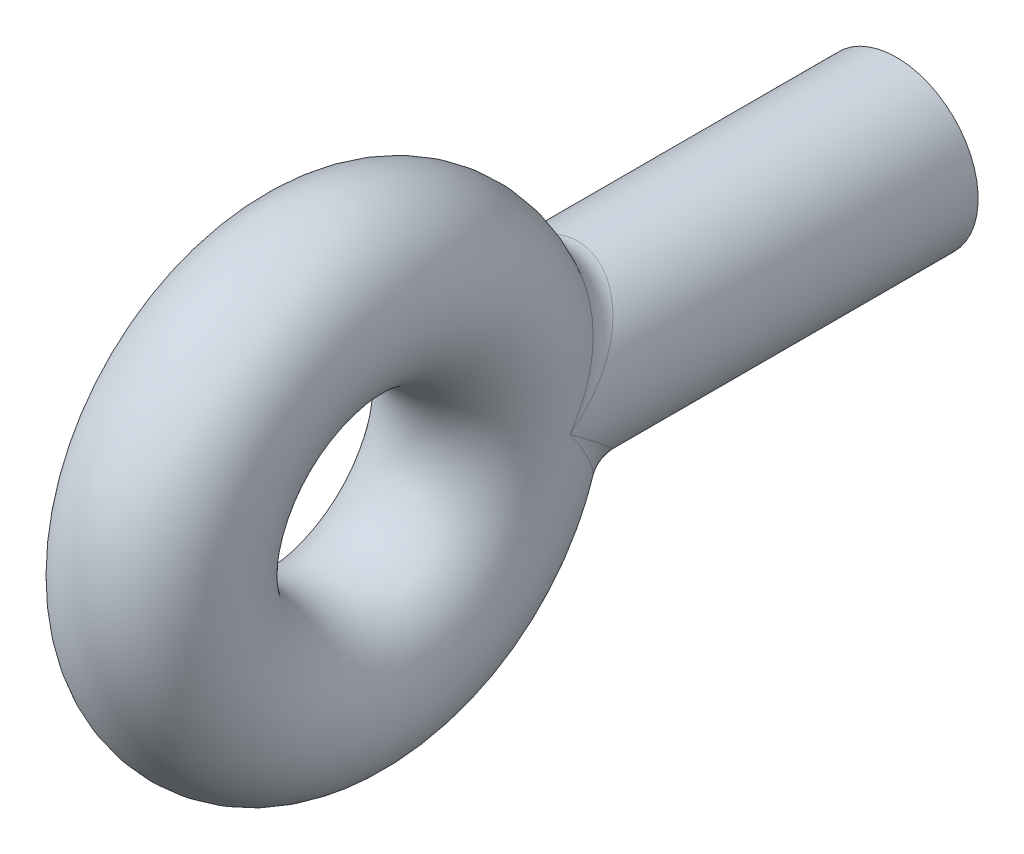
ISO-10303-21;
HEADER;
FILE_DESCRIPTION(('STEP AP214'),'2;1');
FILE_NAME('part.step','',(''),(''),'','','');
FILE_SCHEMA(('AUTOMOTIVE_DESIGN { 1 0 10303 214 1 1 1 1 }'));
ENDSEC;
DATA;
#1=APPLICATION_CONTEXT('core data for automotive mechanical design processes');
#2=APPLICATION_PROTOCOL_DEFINITION('international standard','automotive_design',2000,#1);
#3=PRODUCT_CONTEXT('',#1,'mechanical');
#4=PRODUCT('Part','Part','',(#3));
#5=PRODUCT_RELATED_PRODUCT_CATEGORY('part','',(#4));
#6=PRODUCT_DEFINITION_FORMATION('','',#4);
#7=PRODUCT_DEFINITION_CONTEXT('part definition',#1,'design');
#8=PRODUCT_DEFINITION('design','',#6,#7);
#9=PRODUCT_DEFINITION_SHAPE('','',#8);
#10=(LENGTH_UNIT() NAMED_UNIT(*) SI_UNIT(.MILLI.,.METRE.));
#11=(NAMED_UNIT(*) PLANE_ANGLE_UNIT() SI_UNIT($,.RADIAN.));
#12=(NAMED_UNIT(*) SI_UNIT($,.STERADIAN.) SOLID_ANGLE_UNIT());
#13=UNCERTAINTY_MEASURE_WITH_UNIT(LENGTH_MEASURE(1.E-05),#10,'distance_accuracy_value','');
#14=(GEOMETRIC_REPRESENTATION_CONTEXT(3) GLOBAL_UNCERTAINTY_ASSIGNED_CONTEXT((#13)) GLOBAL_UNIT_ASSIGNED_CONTEXT((#10,
#11,#12)) REPRESENTATION_CONTEXT('',''));
#15=CARTESIAN_POINT('',(0.,0.,0.));
#16=DIRECTION('',(0.,0.,1.));
#17=DIRECTION('',(1.,0.,0.));
#18=AXIS2_PLACEMENT_3D('',#15,#16,#17);
#19=CARTESIAN_POINT('',(0.,0.,-24.13));
#20=DIRECTION('',(0.,0.,-1.));
#21=DIRECTION('',(-1.,0.,0.));
#22=AXIS2_PLACEMENT_3D('',#19,#20,#21);
#23=PLANE('',#22);
#24=CARTESIAN_POINT('',(0.,0.,-24.13));
#25=DIRECTION('',(0.,0.,-1.));
#26=DIRECTION('',(-1.,0.,0.));
#27=AXIS2_PLACEMENT_3D('',#24,#25,#26);
#28=CIRCLE('',#27,4.7625);
#29=CARTESIAN_POINT('',(-4.7625,0.,-24.13));
#30=VERTEX_POINT('',#29);
#31=EDGE_CURVE('E109',#30,#30,#28,.T.);
#32=ORIENTED_EDGE('',*,*,#31,.T.);
#33=EDGE_LOOP('',(#32));
#34=FACE_BOUND('',#33,.T.);
#35=ADVANCED_FACE('F14',(#34),#23,.T.);
#36=CARTESIAN_POINT('',(0.,0.,-24.13));
#37=DIRECTION('',(0.,0.,-1.));
#38=DIRECTION('',(-1.,0.,0.));
#39=AXIS2_PLACEMENT_3D('',#36,#37,#38);
#40=CYLINDRICAL_SURFACE('',#39,4.7625);
#41=ORIENTED_EDGE('',*,*,#31,.F.);
#42=EDGE_LOOP('',(#41));
#43=FACE_BOUND('',#42,.T.);
#44=CARTESIAN_POINT('',(0.,0.,-44.45));
#45=DIRECTION('',(0.,0.,-1.));
#46=DIRECTION('',(-1.,0.,0.));
#47=AXIS2_PLACEMENT_3D('',#44,#45,#46);
#48=CIRCLE('',#47,4.7625);
#49=CARTESIAN_POINT('',(-4.7625,0.,-44.45));
#50=VERTEX_POINT('',#49);
#51=EDGE_CURVE('E110',#50,#50,#48,.T.);
#52=ORIENTED_EDGE('',*,*,#51,.T.);
#53=EDGE_LOOP('',(#52));
#54=FACE_BOUND('',#53,.T.);
#55=ADVANCED_FACE('F178',(#43,#54),#40,.F.);
#56=CARTESIAN_POINT('',(0.,0.,-44.45));
#57=DIRECTION('',(0.,0.,1.));
#58=DIRECTION('',(1.,0.,0.));
#59=AXIS2_PLACEMENT_3D('',#56,#57,#58);
#60=PLANE('',#59);
#61=CARTESIAN_POINT('',(0.,0.,-44.4499999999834));
#62=DIRECTION('',(0.,0.,-1.));
#63=DIRECTION('',(-1.,0.,0.));
#64=AXIS2_PLACEMENT_3D('',#61,#62,#63);
#65=CIRCLE('',#64,6.35);
#66=CARTESIAN_POINT('',(-6.35,0.,-44.4499999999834));
#67=VERTEX_POINT('',#66);
#68=EDGE_CURVE('E54',#67,#67,#65,.F.);
#69=ORIENTED_EDGE('',*,*,#68,.F.);
#70=EDGE_LOOP('',(#69));
#71=FACE_BOUND('',#70,.T.);
#72=ORIENTED_EDGE('',*,*,#51,.F.);
#73=EDGE_LOOP('',(#72));
#74=FACE_BOUND('',#73,.T.);
#75=ADVANCED_FACE('F78',(#71,#74),#60,.F.);
#76=CARTESIAN_POINT('',(6.35,0.,-12.7));
#77=CARTESIAN_POINT('',(6.35,0.,-12.7));
#78=CARTESIAN_POINT('',(6.35,0.,-12.7));
#79=CARTESIAN_POINT('',(6.35,-0.676630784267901,-13.6467861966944));
#80=CARTESIAN_POINT('',(6.35000000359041,-0.811757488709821,-13.511331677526));
#81=CARTESIAN_POINT('',(6.35,-0.946815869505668,-13.3759422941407));
#82=CARTESIAN_POINT('',(6.24390570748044,-1.37645536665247,-14.5226124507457));
#83=CARTESIAN_POINT('',(6.19591618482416,-1.63312053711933,-14.2567862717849));
#84=CARTESIAN_POINT('',(6.24390570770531,-1.86712318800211,-13.9735622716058));
#85=CARTESIAN_POINT('',(5.87628639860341,-2.43544249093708,-15.7499750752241));
#86=CARTESIAN_POINT('',(5.73241221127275,-2.78942628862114,-15.2480369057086));
#87=CARTESIAN_POINT('',(5.87628639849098,-3.20629891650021,-14.7970019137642));
#88=CARTESIAN_POINT('',(5.71665841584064,-2.79255052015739,-16.1471297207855));
#89=CARTESIAN_POINT('',(5.53279346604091,-3.17188584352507,-15.5651351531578));
#90=CARTESIAN_POINT('',(5.71665841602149,-3.64884216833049,-15.0606255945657));
#91=CARTESIAN_POINT('',(5.32651236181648,-3.47948098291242,-16.8865936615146));
#92=CARTESIAN_POINT('',(5.06574589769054,-3.88194053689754,-16.1409488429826));
#93=CARTESIAN_POINT('',(5.32651236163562,-4.48750374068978,-15.548481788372));
#94=CARTESIAN_POINT('',(5.09572044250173,-3.81195051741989,-17.2321347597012));
#95=CARTESIAN_POINT('',(4.79567506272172,-4.21295460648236,-16.402458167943));
#96=CARTESIAN_POINT('',(5.09572044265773,-4.88705601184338,-15.7748859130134));
#97=CARTESIAN_POINT('',(4.6878367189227,-4.28840241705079,-17.7147245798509));
#98=CARTESIAN_POINT('',(4.34328264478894,-4.66519872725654,-16.7547474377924));
#99=CARTESIAN_POINT('',(4.6878367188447,-5.45350238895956,-16.0899529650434));
#100=CARTESIAN_POINT('',(4.54069060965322,-4.44417834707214,-17.8702655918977));
#101=CARTESIAN_POINT('',(4.18210869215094,-4.8102853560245,-16.8667915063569));
#102=CARTESIAN_POINT('',(4.54069060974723,-5.6376056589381,-16.1912862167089));
#103=CARTESIAN_POINT('',(4.23015232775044,-4.7407176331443,-18.1629108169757));
#104=CARTESIAN_POINT('',(3.84974046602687,-5.08002182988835,-17.0739343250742));
#105=CARTESIAN_POINT('',(4.23015232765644,-5.98642616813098,-16.3816613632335));
#106=CARTESIAN_POINT('',(4.06636733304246,-4.88210189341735,-18.3006627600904));
#107=CARTESIAN_POINT('',(3.67797131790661,-5.20507138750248,-17.1693407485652));
#108=CARTESIAN_POINT('',(4.066367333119,-6.15189050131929,-16.4711273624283));
#109=CARTESIAN_POINT('',(3.72109204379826,-5.15012001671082,-18.5592290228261));
#110=CARTESIAN_POINT('',(3.32436514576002,-5.43635955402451,-17.3451801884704));
#111=CARTESIAN_POINT('',(3.72109204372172,-6.46436204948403,-16.6388789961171));
#112=CARTESIAN_POINT('',(3.53960796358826,-5.27676006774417,-18.6800472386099));
#113=CARTESIAN_POINT('',(3.14253051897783,-5.5423234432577,-17.425395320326));
#114=CARTESIAN_POINT('',(3.53960796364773,-6.61137525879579,-16.7171665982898));
#115=CARTESIAN_POINT('',(3.15765612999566,-5.51382164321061,-18.904340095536));
#116=CARTESIAN_POINT('',(2.76905490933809,-5.73569531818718,-17.5715247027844));
#117=CARTESIAN_POINT('',(3.15765612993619,-6.88572168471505,-16.8623893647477));
#118=CARTESIAN_POINT('',(2.95589450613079,-5.62475694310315,-19.0082854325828));
#119=CARTESIAN_POINT('',(2.57636170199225,-5.82317757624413,-17.6374900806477));
#120=CARTESIAN_POINT('',(2.95589450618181,-7.01364234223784,-16.9296281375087));
#121=CARTESIAN_POINT('',(2.33506061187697,-5.92290502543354,-19.285816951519));
#122=CARTESIAN_POINT('',(1.9943657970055,-6.05375608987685,-17.8113240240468));
#123=CARTESIAN_POINT('',(2.33506061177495,-7.35662159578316,-17.1090558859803));
#124=CARTESIAN_POINT('',(1.89782839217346,-6.07834359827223,-19.4279553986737));
#125=CARTESIAN_POINT('',(1.60606833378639,-6.16372209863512,-17.8942423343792));
#126=CARTESIAN_POINT('',(1.89782839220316,-7.5342950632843,-17.2008155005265));
#127=CARTESIAN_POINT('',(1.20393770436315,-6.23934390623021,-19.574561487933));
#128=CARTESIAN_POINT('',(1.00981306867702,-6.27547210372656,-17.9787232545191));
#129=CARTESIAN_POINT('',(1.20393770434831,-7.71806173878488,-17.2954368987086));
#130=CARTESIAN_POINT('',(0.966149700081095,-6.28061165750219,-19.6119648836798));
#131=CARTESIAN_POINT('',(0.808389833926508,-6.30339644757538,-17.9998697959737));
#132=CARTESIAN_POINT('',(0.966149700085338,-7.76508878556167,-17.3195697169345));
#133=CARTESIAN_POINT('',(0.491695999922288,-6.33543708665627,-19.6616062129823));
#134=CARTESIAN_POINT('',(0.409508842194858,-6.34036640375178,-18.0278826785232));
#135=CARTESIAN_POINT('',(0.491695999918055,-7.82754398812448,-17.3515964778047));
#136=CARTESIAN_POINT('',(0.254355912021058,-6.34934536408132,-19.6741638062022));
#137=CARTESIAN_POINT('',(0.21195771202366,-6.3495635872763,-18.0348614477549));
#138=CARTESIAN_POINT('',(0.254355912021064,-7.84337240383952,-17.3596966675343));
#139=CARTESIAN_POINT('',(-0.220546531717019,-6.35060963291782,-19.6753063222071));
#140=CARTESIAN_POINT('',(-0.183796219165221,-6.3504064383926,-18.0355007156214));
#141=CARTESIAN_POINT('',(-0.220546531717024,-7.84481165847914,-17.3604336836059));
#142=CARTESIAN_POINT('',(-0.458108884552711,-6.33796596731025,-19.6638915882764));
#143=CARTESIAN_POINT('',(-0.381449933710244,-6.34205038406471,-18.029159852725));
#144=CARTESIAN_POINT('',(-0.458108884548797,-7.83042290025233,-17.35307073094));
#145=CARTESIAN_POINT('',(-0.933460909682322,-6.2855649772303,-19.6164536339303));
#146=CARTESIAN_POINT('',(-0.780775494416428,-6.30675077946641,-18.0024104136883));
#147=CARTESIAN_POINT('',(-0.93346090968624,-7.77073307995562,-17.3224658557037));
#148=CARTESIAN_POINT('',(-1.17018422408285,-6.24569864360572,-19.5803289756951));
#149=CARTESIAN_POINT('',(-0.9810839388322,-6.27981044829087,-17.98200671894));
#150=CARTESIAN_POINT('',(-1.17018422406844,-7.72530673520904,-17.299158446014));
#151=CARTESIAN_POINT('',(-1.63009878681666,-6.14173107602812,-19.4856920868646));
#152=CARTESIAN_POINT('',(-1.37673735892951,-6.20759605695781,-17.9274070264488));
#153=CARTESIAN_POINT('',(-1.63009878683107,-7.60665303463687,-17.2380802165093));
#154=CARTESIAN_POINT('',(-1.85500744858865,-6.07746977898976,-19.4270354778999));
#155=CARTESIAN_POINT('',(-1.57304725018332,-6.16239002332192,-17.8932645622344));
#156=CARTESIAN_POINT('',(-1.85500744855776,-7.53324372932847,-17.2002164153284));
#157=CARTESIAN_POINT('',(-2.29502966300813,-5.92532956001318,-19.2872911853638));
#158=CARTESIAN_POINT('',(-1.96531956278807,-6.05180438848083,-17.8098400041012));
#159=CARTESIAN_POINT('',(-2.29502966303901,-7.35906075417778,-17.1099667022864));
#160=CARTESIAN_POINT('',(-2.51128026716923,-5.83688624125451,-19.2056796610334));
#161=CARTESIAN_POINT('',(-2.16194996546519,-5.98624483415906,-17.7604251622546));
#162=CARTESIAN_POINT('',(-2.51128026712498,-7.25763873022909,-17.0572424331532));
#163=CARTESIAN_POINT('',(-3.13695680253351,-5.54031409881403,-18.9298017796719));
#164=CARTESIAN_POINT('',(-2.74182649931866,-5.75960955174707,-17.5895692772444));
#165=CARTESIAN_POINT('',(-3.13695680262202,-6.9165559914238,-16.8788940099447));
#166=CARTESIAN_POINT('',(-3.51859149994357,-5.30439745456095,-18.7077914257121));
#167=CARTESIAN_POINT('',(-3.11476968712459,-5.57080704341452,-17.4473245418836));
#168=CARTESIAN_POINT('',(-3.51859149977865,-6.64410006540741,-16.7352431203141));
#169=CARTESIAN_POINT('',(-4.04335622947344,-4.90126769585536,-18.3192753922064));
#170=CARTESIAN_POINT('',(-3.6540217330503,-5.22190070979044,-17.1821665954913));
#171=CARTESIAN_POINT('',(-4.0433562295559,-6.17429233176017,-16.4832115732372));
#172=CARTESIAN_POINT('',(-4.21048564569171,-4.7582034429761,-18.1800149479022));
#173=CARTESIAN_POINT('',(-3.82899530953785,-5.09563093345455,-17.0858675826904));
#174=CARTESIAN_POINT('',(-4.21048564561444,-6.00692224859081,-16.3927755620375));
#175=CARTESIAN_POINT('',(-4.52256681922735,-4.46263136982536,-17.8886109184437));
#176=CARTESIAN_POINT('',(-4.16243675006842,-4.82732446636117,-16.8799235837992));
#177=CARTESIAN_POINT('',(-4.52256681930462,-5.65937626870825,-16.2032315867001));
#178=CARTESIAN_POINT('',(-4.66848450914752,-4.30944795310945,-17.7358256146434));
#179=CARTESIAN_POINT('',(-4.32199373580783,-4.68494126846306,-16.7700328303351));
#180=CARTESIAN_POINT('',(-4.66848450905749,-5.47841758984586,-16.1037084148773));
#181=CARTESIAN_POINT('',(-4.94147502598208,-3.99348392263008,-17.4161944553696));
#182=CARTESIAN_POINT('',(-4.62588556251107,-4.38401393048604,-16.5357906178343));
#183=CARTESIAN_POINT('',(-4.94147502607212,-5.10297013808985,-15.8950704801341));
#184=CARTESIAN_POINT('',(-5.0685418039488,-3.83069909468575,-17.2493462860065));
#185=CARTESIAN_POINT('',(-4.77041241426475,-4.22561227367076,-16.4115712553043));
#186=CARTESIAN_POINT('',(-5.06854180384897,-4.90847752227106,-15.7859549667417));
#187=CARTESIAN_POINT('',(-5.3046546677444,-3.49642823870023,-16.9012802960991));
#188=CARTESIAN_POINT('',(-5.04328825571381,-3.89332336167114,-16.1481980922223));
#189=CARTESIAN_POINT('',(-5.30465466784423,-4.50636250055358,-15.5577150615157));
#190=CARTESIAN_POINT('',(-5.41348311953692,-3.32507207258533,-16.7201642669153));
#191=CARTESIAN_POINT('',(-5.17165410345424,-3.71958280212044,-16.0091679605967));
#192=CARTESIAN_POINT('',(-5.41348311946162,-4.29887927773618,-15.4386537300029));
#193=CARTESIAN_POINT('',(-5.70915348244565,-2.80814558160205,-16.1643118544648));
#194=CARTESIAN_POINT('',(-5.52353204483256,-3.18843338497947,-15.5787708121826));
#195=CARTESIAN_POINT('',(-5.70915348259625,-3.66808527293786,-15.0720124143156));
#196=CARTESIAN_POINT('',(-5.86754917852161,-2.45682258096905,-15.7741403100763));
#197=CARTESIAN_POINT('',(-5.72144654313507,-2.81259015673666,-15.2675017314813));
#198=CARTESIAN_POINT('',(-5.86754917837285,-3.23300312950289,-14.813108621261));
#199=CARTESIAN_POINT('',(-6.05437646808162,-1.92416948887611,-15.1576940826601));
#200=CARTESIAN_POINT('',(-5.95925649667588,-2.22542611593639,-14.7647228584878));
#201=CARTESIAN_POINT('',(-6.05437646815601,-2.55990557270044,-14.3996882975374));
#202=CARTESIAN_POINT('',(-6.10826200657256,-1.74509883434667,-14.9462993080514));
#203=CARTESIAN_POINT('',(-6.02878432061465,-2.02593392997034,-14.5912817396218));
#204=CARTESIAN_POINT('',(-6.10826200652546,-2.33137104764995,-14.2572064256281));
#205=CARTESIAN_POINT('',(-6.19891747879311,-1.38912086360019,-14.5166554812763));
#206=CARTESIAN_POINT('',(-6.14682600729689,-1.624745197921,-14.2361347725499));
#207=CARTESIAN_POINT('',(-6.1989174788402,-1.87186204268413,-13.9657368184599));
#208=CARTESIAN_POINT('',(-6.23576882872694,-1.21218304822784,-14.2984075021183));
#209=CARTESIAN_POINT('',(-6.19564084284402,-1.42274675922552,-14.0542185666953));
#210=CARTESIAN_POINT('',(-6.23576882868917,-1.64086839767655,-13.816756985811));
#211=CARTESIAN_POINT('',(-6.32295768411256,-0.685207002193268,-13.6327866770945));
#212=CARTESIAN_POINT('',(-6.3117895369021,-0.816282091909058,-13.4972098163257));
#213=CARTESIAN_POINT('',(-6.32295768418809,-0.944116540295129,-13.3588155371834));
#214=CARTESIAN_POINT('',(-6.35,-0.338971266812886,-13.1743108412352));
#215=CARTESIAN_POINT('',(-6.35000000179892,-0.406718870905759,-13.1065055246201));
#216=CARTESIAN_POINT('',(-6.35,-0.474460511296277,-13.0387225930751));
#217=CARTESIAN_POINT('',(-6.35,0.,-12.7));
#218=CARTESIAN_POINT('',(-6.35,0.,-12.7));
#219=CARTESIAN_POINT('',(-6.35,0.,-12.7));
#220=(BOUNDED_SURFACE() B_SPLINE_SURFACE(3,2,((#76,#77,#78),(#79,#80,#81),(#82,#83,#84),(#85,
#86,#87),(#88,#89,#90),(#91,#92,#93),(#94,#95,#96),(#97,#98,#99),(#100,#101,#102),(#103,#104,
#105),(#106,#107,#108),(#109,#110,#111),(#112,#113,#114),(#115,#116,#117),(#118,#119,#120),
(#121,#122,#123),(#124,#125,#126),(#127,#128,#129),(#130,#131,#132),(#133,#134,#135),(#136,#137,
#138),(#139,#140,#141),(#142,#143,#144),(#145,#146,#147),(#148,#149,#150),(#151,#152,#153),
(#154,#155,#156),(#157,#158,#159),(#160,#161,#162),(#163,#164,#165),(#166,#167,#168),(#169,#170,
#171),(#172,#173,#174),(#175,#176,#177),(#178,#179,#180),(#181,#182,#183),(#184,#185,#186),
(#187,#188,#189),(#190,#191,#192),(#193,#194,#195),(#196,#197,#198),(#199,#200,#201),(#202,#203,
#204),(#205,#206,#207),(#208,#209,#210),(#211,#212,#213),(#214,#215,#216),(#217,#218,#219)),
.UNSPECIFIED.,.F.,.F.,.F.) B_SPLINE_SURFACE_WITH_KNOTS((4,2,2,2,2,2,2,2,2,2,2,2,2,2,2,2,2,2,2,2,
2,2,2,4),(3,3),(-1.88573626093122E-05,0.00394301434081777,0.00592395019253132,
0.00790488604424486,0.00889535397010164,0.00988582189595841,0.0108762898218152,
0.011866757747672,0.0138476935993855,0.0148381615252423,0.015828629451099,0.0168190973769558,
0.0178095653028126,0.0188000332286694,0.0197905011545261,0.0217714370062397,0.0227619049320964,
0.0237523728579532,0.02474284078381,0.0257333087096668,0.0277142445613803,0.0287047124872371,
0.0296951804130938,0.0316761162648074),(0.,1.),
.UNSPECIFIED.) GEOMETRIC_REPRESENTATION_ITEM() RATIONAL_B_SPLINE_SURFACE(((1.,1.,1.),(1.,
0.999946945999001,1.),(1.,0.991635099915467,1.),(1.,0.971015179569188,1.),(1.,0.962684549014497,
1.),(1.,0.944542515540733,1.),(1.,0.934691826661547,1.),(1.,0.919393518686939,1.),(1.,
0.914181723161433,1.),(1.,0.903921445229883,1.),(1.,0.898854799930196,1.),(1.,0.888984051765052,
1.),(1.,0.884179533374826,1.),(1.,0.874981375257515,1.),(1.,0.870566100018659,1.),(1.,
0.858489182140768,1.),(1.,0.851896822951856,1.),(1.,0.844987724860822,1.),(1.,0.843195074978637,
1.),(1.,0.840807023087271,1.),(1.,0.840196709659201,1.),(1.,0.84014136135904,1.),(1.,
0.840696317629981,1.),(1.,0.842979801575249,1.),(1.,0.84471265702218,1.),(1.,0.849178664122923,
1.),(1.,0.851918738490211,1.),(1.,0.858300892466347,1.),(1.,0.861965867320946,1.),(1.,
0.874000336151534,1.),(1.,0.883273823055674,1.),(1.,0.898161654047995,1.),(1.,0.903301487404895,
1.),(1.,0.913556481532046,1.),(1.,0.918697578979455,1.),(1.,0.92888057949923,1.),(1.,
0.933922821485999,1.),(1.,0.943786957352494,1.),(1.,0.948602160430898,1.),(1.,0.96230680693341,
1.),(1.,0.970548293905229,1.),(1.,0.980993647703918,1.),(1.,0.984163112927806,1.),(1.,
0.989699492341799,1.),(1.,0.992069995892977,1.),(1.,0.997871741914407,1.),(1.,0.999997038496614,
1.),(1.,1.,1.))) REPRESENTATION_ITEM('') SURFACE());
#221=CARTESIAN_POINT('',(-6.35,0.,-12.7));
#222=CARTESIAN_POINT('',(-6.35000000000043,-0.338987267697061,-13.1742948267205));
#223=CARTESIAN_POINT('',(-6.32295505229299,-0.685237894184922,-13.632754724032));
#224=CARTESIAN_POINT('',(-6.23575942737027,-1.21223238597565,-14.29835028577));
#225=CARTESIAN_POINT('',(-6.19890530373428,-1.38917594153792,-14.5165899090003));
#226=CARTESIAN_POINT('',(-6.10824353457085,-1.74516411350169,-14.9462167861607));
#227=CARTESIAN_POINT('',(-6.05435443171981,-1.92423928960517,-15.1576030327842));
#228=CARTESIAN_POINT('',(-5.86751569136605,-2.45690413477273,-15.7740241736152));
#229=CARTESIAN_POINT('',(-5.70911129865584,-2.80823201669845,-16.1641787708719));
#230=CARTESIAN_POINT('',(-5.41342894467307,-3.32516046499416,-16.7200049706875));
#231=CARTESIAN_POINT('',(-5.30459641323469,-3.49651671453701,-16.9011124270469));
#232=CARTESIAN_POINT('',(-5.06847604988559,-3.83078620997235,-17.2491614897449));
#233=CARTESIAN_POINT('',(-4.94140579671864,-3.99356960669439,-17.4160013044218));
#234=CARTESIAN_POINT('',(-4.66840933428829,-4.3095294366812,-17.7356160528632));
#235=CARTESIAN_POINT('',(-4.5224891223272,-4.46271006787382,-17.8883932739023));
#236=CARTESIAN_POINT('',(-4.21040426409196,-4.75827544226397,-18.1797815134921));
#237=CARTESIAN_POINT('',(-4.0432736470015,-4.90133572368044,-18.319034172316));
#238=CARTESIAN_POINT('',(-3.51850726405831,-5.30445304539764,-18.7075284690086));
#239=CARTESIAN_POINT('',(-3.13687524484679,-5.54035938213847,-18.9295251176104));
#240=CARTESIAN_POINT('',(-2.51120915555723,-5.83691666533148,-19.2053854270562));
#241=CARTESIAN_POINT('',(-2.29496283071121,-5.92535521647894,-19.2869916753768));
#242=CARTESIAN_POINT('',(-1.8549507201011,-6.07748688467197,-19.4267268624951));
#243=CARTESIAN_POINT('',(-1.63004797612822,-6.14174430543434,-19.4853795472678));
#244=CARTESIAN_POINT('',(-1.17014650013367,-6.24570546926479,-19.5800100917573));
#245=CARTESIAN_POINT('',(-0.933430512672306,-6.28556921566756,-19.6161322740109));
#246=CARTESIAN_POINT('',(-0.458093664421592,-6.33796679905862,-19.6635669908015));
#247=CARTESIAN_POINT('',(-0.22053923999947,-6.3506096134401,-19.6749809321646));
#248=CARTESIAN_POINT('',(0.254347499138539,-6.34934542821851,-19.6738384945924));
#249=CARTESIAN_POINT('',(0.491679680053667,-6.33543808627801,-19.6612817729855));
#250=CARTESIAN_POINT('',(0.96611828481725,-6.28061621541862,-19.6116438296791));
#251=CARTESIAN_POINT('',(1.20389896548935,-6.2393511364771,-19.5742429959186));
#252=CARTESIAN_POINT('',(1.89776969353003,-6.07836079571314,-19.4276468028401));
#253=CARTESIAN_POINT('',(2.3349915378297,-5.92293157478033,-19.285517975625));
#254=CARTESIAN_POINT('',(2.9558164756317,-5.62479775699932,-19.0080035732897));
#255=CARTESIAN_POINT('',(3.15757582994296,-5.51386751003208,-18.9040646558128));
#256=CARTESIAN_POINT('',(3.53952504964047,-5.27681553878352,-18.6797852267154));
#257=CARTESIAN_POINT('',(3.72100875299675,-5.15018012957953,-18.558974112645));
#258=CARTESIAN_POINT('',(4.0662848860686,-4.88217046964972,-18.3004225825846));
#259=CARTESIAN_POINT('',(4.23007112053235,-4.74079008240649,-18.1626783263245));
#260=CARTESIAN_POINT('',(4.54061319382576,-4.4442574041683,-17.8700489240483));
#261=CARTESIAN_POINT('',(4.68776190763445,-4.28848424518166,-17.7145161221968));
#262=CARTESIAN_POINT('',(5.0956542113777,-3.81203904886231,-17.2319515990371));
#263=CARTESIAN_POINT('',(5.32645419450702,-3.4795707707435,-16.8864273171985));
#264=CARTESIAN_POINT('',(5.71661661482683,-2.79263677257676,-16.1469973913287));
#265=CARTESIAN_POINT('',(5.87625340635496,-2.43552367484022,-15.7498599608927));
#266=CARTESIAN_POINT('',(6.24389446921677,-1.37651547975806,-14.5225501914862));
#267=CARTESIAN_POINT('',(6.35000000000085,-0.676662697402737,-13.6467542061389));
#268=CARTESIAN_POINT('',(6.35,0.,-12.7));
#269=(BOUNDED_CURVE() B_SPLINE_CURVE(3,(#221,#222,#223,#224,#225,#226,#227,#228,#229,#230,#231,
#232,#233,#234,#235,#236,#237,#238,#239,#240,#241,#242,#243,#244,#245,#246,#247,#248,#249,#250,
#251,#252,#253,#254,#255,#256,#257,#258,#259,#260,#261,#262,#263,#264,#265,#266,#267,#268),
.UNSPECIFIED.,.F.,.F.) B_SPLINE_CURVE_WITH_KNOTS((4,2,2,2,2,2,2,2,2,2,2,2,2,2,2,2,2,2,2,2,2,2,2,
4),(-1.88573626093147E-05,0.00196207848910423,0.002952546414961,0.00394301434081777,
0.00592395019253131,0.00691441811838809,0.00790488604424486,0.00889535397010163,
0.00988582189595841,0.011866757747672,0.0128572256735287,0.0138476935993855,0.0148381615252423,
0.015828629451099,0.0168190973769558,0.0178095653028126,0.0197905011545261,0.0207809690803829,
0.0217714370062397,0.0227619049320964,0.0237523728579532,0.0257333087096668,0.0277142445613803,
0.0316761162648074),
.UNSPECIFIED.) CURVE() GEOMETRIC_REPRESENTATION_ITEM() RATIONAL_B_SPLINE_CURVE((1.,
0.999999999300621,0.999999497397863,0.999998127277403,0.999997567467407,0.999996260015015,
0.999995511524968,0.999993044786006,0.999991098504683,0.999987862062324,0.999986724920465,
0.999984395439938,0.999983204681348,0.999980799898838,0.999979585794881,0.999977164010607,
0.999975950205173,0.99997243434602,0.999970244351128,0.999967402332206,0.999966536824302,
0.999965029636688,0.999964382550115,0.999963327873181,0.999962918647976,0.999962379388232,
0.99996224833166,0.999962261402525,0.999962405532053,0.999962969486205,0.999963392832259,
0.99996502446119,0.999966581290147,0.999969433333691,0.999970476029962,0.999972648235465,
0.999973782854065,0.99997611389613,0.999977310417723,0.999979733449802,0.999980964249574,
0.999984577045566,0.999986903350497,0.999991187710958,0.999993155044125,0.999998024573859,
0.999999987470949,1.)) REPRESENTATION_ITEM(''));
#270=CARTESIAN_POINT('',(6.35,0.,-12.6999999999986));
#271=VERTEX_POINT('',#270);
#272=CARTESIAN_POINT('',(-6.35,0.,-12.6999999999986));
#273=VERTEX_POINT('',#272);
#274=EDGE_CURVE('E33',#271,#273,#269,.F.);
#275=CARTESIAN_POINT('',(0.,-7.84411764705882,-17.3600782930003));
#276=CARTESIAN_POINT('',(0.0858098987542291,-7.84412210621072,-17.3600794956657));
#277=CARTESIAN_POINT('',(0.171619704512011,-7.8421631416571,-17.359052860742));
#278=CARTESIAN_POINT('',(0.342803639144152,-7.83433427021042,-17.3549690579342));
#279=CARTESIAN_POINT('',(0.428178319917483,-7.82847385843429,-17.3519168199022));
#280=CARTESIAN_POINT('',(0.598354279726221,-7.81286899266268,-17.3438124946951));
#281=CARTESIAN_POINT('',(0.683156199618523,-7.80313005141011,-17.3387632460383));
#282=CARTESIAN_POINT('',(0.852052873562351,-7.77981028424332,-17.3266953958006));
#283=CARTESIAN_POINT('',(0.936147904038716,-7.76623103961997,-17.3196776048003));
#284=CARTESIAN_POINT('',(1.1035009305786,-7.73527927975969,-17.3037006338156));
#285=CARTESIAN_POINT('',(1.18675841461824,-7.71790457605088,-17.2947403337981));
#286=CARTESIAN_POINT('',(1.35231057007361,-7.67941885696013,-17.2749043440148));
#287=CARTESIAN_POINT('',(1.43460356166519,-7.6583021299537,-17.2640257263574));
#288=CARTESIAN_POINT('',(1.59810513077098,-7.61239669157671,-17.2403769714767));
#289=CARTESIAN_POINT('',(1.6793105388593,-7.58759906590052,-17.2276022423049));
#290=CARTESIAN_POINT('',(1.84051961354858,-7.53440334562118,-17.2001830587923));
#291=CARTESIAN_POINT('',(1.92051836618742,-7.50599351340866,-17.1855325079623));
#292=CARTESIAN_POINT('',(2.0792010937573,-7.4456515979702,-17.1543815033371));
#293=CARTESIAN_POINT('',(2.15787822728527,-7.4137053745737,-17.1378736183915));
#294=CARTESIAN_POINT('',(2.31380917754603,-7.34637557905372,-17.1030256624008));
#295=CARTESIAN_POINT('',(2.39105411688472,-7.31097591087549,-17.084676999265));
#296=CARTESIAN_POINT('',(2.54401606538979,-7.23682927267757,-17.0461640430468));
#297=CARTESIAN_POINT('',(2.61972212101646,-7.1980646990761,-17.0259901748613));
#298=CARTESIAN_POINT('',(2.76950791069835,-7.11728761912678,-16.9838392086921));
#299=CARTESIAN_POINT('',(2.84357465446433,-7.0752564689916,-16.961851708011));
#300=CARTESIAN_POINT('',(2.98667860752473,-6.99000504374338,-16.9171258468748));
#301=CARTESIAN_POINT('',(3.05579964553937,-6.94689300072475,-16.8944490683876));
#302=CARTESIAN_POINT('',(3.192053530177,-6.85805318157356,-16.8476120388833));
#303=CARTESIAN_POINT('',(3.25918173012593,-6.81231992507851,-16.823448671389));
#304=CARTESIAN_POINT('',(3.39139757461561,-6.71834717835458,-16.7736829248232));
#305=CARTESIAN_POINT('',(3.45647943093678,-6.67010145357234,-16.7480769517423));
#306=CARTESIAN_POINT('',(3.5845552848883,-6.57121101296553,-16.6954705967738));
#307=CARTESIAN_POINT('',(3.64754242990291,-6.52055953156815,-16.66846626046));
#308=CARTESIAN_POINT('',(3.77138776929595,-6.41696710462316,-16.6131052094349));
#309=CARTESIAN_POINT('',(3.83223814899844,-6.36401907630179,-16.5847442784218));
#310=CARTESIAN_POINT('',(3.95177454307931,-6.25594370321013,-16.526710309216));
#311=CARTESIAN_POINT('',(4.01045189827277,-6.20080914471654,-16.497032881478));
#312=CARTESIAN_POINT('',(4.12561241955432,-6.08847150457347,-16.4364043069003));
#313=CARTESIAN_POINT('',(4.18208621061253,-6.03126124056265,-16.4054486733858));
#314=CARTESIAN_POINT('',(4.29281516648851,-5.91488322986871,-16.3423003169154));
#315=CARTESIAN_POINT('',(4.34706037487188,-5.85570846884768,-16.3101030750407));
#316=CARTESIAN_POINT('',(4.45331291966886,-5.73551245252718,-16.2445064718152));
#317=CARTESIAN_POINT('',(4.50530985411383,-5.67448446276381,-16.2111026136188));
#318=CARTESIAN_POINT('',(4.60705167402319,-5.5506927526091,-16.1431260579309));
#319=CARTESIAN_POINT('',(4.65678584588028,-5.4879226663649,-16.1085489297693));
#320=CARTESIAN_POINT('',(4.75399260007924,-5.36075661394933,-16.0382579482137));
#321=CARTESIAN_POINT('',(4.80145428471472,-5.29635471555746,-16.0025397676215));
#322=CARTESIAN_POINT('',(4.89411189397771,-5.16603532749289,-15.9299960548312));
#323=CARTESIAN_POINT('',(4.93929686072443,-5.10011239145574,-15.8931663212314));
#324=CARTESIAN_POINT('',(5.02514714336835,-4.97026078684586,-15.8203422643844));
#325=CARTESIAN_POINT('',(5.06592501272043,-4.90638316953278,-15.7843895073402));
#326=CARTESIAN_POINT('',(5.14536509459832,-4.77755323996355,-15.7116150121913));
#327=CARTESIAN_POINT('',(5.18402194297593,-4.71259869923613,-15.6747913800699));
#328=CARTESIAN_POINT('',(5.29697821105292,-4.51602171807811,-15.5629314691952));
#329=CARTESIAN_POINT('',(5.36797019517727,-4.38313113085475,-15.4867556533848));
#330=CARTESIAN_POINT('',(5.50174623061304,-4.11409559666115,-15.3313118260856));
#331=CARTESIAN_POINT('',(5.56449054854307,-3.9779383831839,-15.2520310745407));
#332=CARTESIAN_POINT('',(5.68199740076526,-3.70299566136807,-15.0905912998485));
#333=CARTESIAN_POINT('',(5.73672389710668,-3.56420127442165,-15.0084212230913));
#334=CARTESIAN_POINT('',(5.83845313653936,-3.28458509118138,-14.8414031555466));
#335=CARTESIAN_POINT('',(5.88542422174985,-3.14375741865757,-14.7565457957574));
#336=CARTESIAN_POINT('',(5.97193842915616,-2.86063019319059,-14.5843295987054));
#337=CARTESIAN_POINT('',(6.01145464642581,-2.71832719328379,-14.4969629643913));
#338=CARTESIAN_POINT('',(6.08338407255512,-2.43276347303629,-14.3198840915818));
#339=CARTESIAN_POINT('',(6.1157751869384,-2.28950115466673,-14.2301654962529));
#340=CARTESIAN_POINT('',(6.1738041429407,-2.00248994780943,-14.0485173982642));
#341=CARTESIAN_POINT('',(6.19942452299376,-1.85874075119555,-13.9565828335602));
#342=CARTESIAN_POINT('',(6.24428142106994,-1.57118491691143,-13.7706167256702));
#343=CARTESIAN_POINT('',(6.26350475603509,-1.42737876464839,-13.6765812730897));
#344=CARTESIAN_POINT('',(6.29595190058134,-1.14009648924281,-13.4865059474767));
#345=CARTESIAN_POINT('',(6.30916633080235,-0.99662122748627,-13.390463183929));
#346=CARTESIAN_POINT('',(6.32999131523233,-0.710350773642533,-13.1964461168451));
#347=CARTESIAN_POINT('',(6.3375957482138,-0.567556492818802,-13.0984698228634));
#348=CARTESIAN_POINT('',(6.34760111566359,-0.282953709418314,-12.9006318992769));
#349=CARTESIAN_POINT('',(6.34999860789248,-0.141145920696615,-12.8007690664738));
#350=CARTESIAN_POINT('',(6.35,0.,-12.7));
#351=B_SPLINE_CURVE_WITH_KNOTS('',3,(#275,#276,#277,#278,#279,#280,#281,#282,#283,#284,#285,
#286,#287,#288,#289,#290,#291,#292,#293,#294,#295,#296,#297,#298,#299,#300,#301,#302,#303,#304,
#305,#306,#307,#308,#309,#310,#311,#312,#313,#314,#315,#316,#317,#318,#319,#320,#321,#322,#323,
#324,#325,#326,#327,#328,#329,#330,#331,#332,#333,#334,#335,#336,#337,#338,#339,#340,#341,#342,
#343,#344,#345,#346,#347,#348,#349,#350),.UNSPECIFIED.,.F.,.F.,(4,2,2,2,2,2,2,2,2,2,2,2,2,2,2,2,
2,2,2,2,2,2,2,2,2,2,2,2,2,2,2,2,2,2,2,2,2,4),(0.,0.257400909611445,0.514177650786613,
0.77059071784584,1.02689835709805,1.2833541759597,1.54020486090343,1.79768804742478,
2.05603037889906,2.31544578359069,2.57613399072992,2.83827929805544,3.10204959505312,
3.35565579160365,3.60981306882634,3.8646342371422,4.12022020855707,4.37665996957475,
4.63403067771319,4.89239786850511,5.15181575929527,5.41232763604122,5.67396630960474,
5.93675462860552,6.20070603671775,6.4523047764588,6.70451297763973,7.21069224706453,
7.71922704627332,8.22998171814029,8.74277235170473,9.25737967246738,9.77356093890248,
10.2910607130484,10.8096204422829,11.3289868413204,11.8489191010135,12.3691949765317),.UNSPECIFIED.);
#352=CARTESIAN_POINT('',(3.24743286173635E-13,-7.84411766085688,-17.3600783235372));
#353=VERTEX_POINT('',#352);
#354=EDGE_CURVE('E51',#353,#271,#351,.T.);
#355=CARTESIAN_POINT('',(-6.35,0.,-12.7));
#356=CARTESIAN_POINT('',(-6.34999859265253,-0.141544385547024,-12.8010535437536));
#357=CARTESIAN_POINT('',(-6.34758755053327,-0.283754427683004,-12.9011957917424));
#358=CARTESIAN_POINT('',(-6.33752443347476,-0.569166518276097,-13.0995818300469));
#359=CARTESIAN_POINT('',(-6.32987583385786,-0.712367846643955,-13.1978268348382));
#360=CARTESIAN_POINT('',(-6.30892841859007,-0.999454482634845,-13.3923701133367));
#361=CARTESIAN_POINT('',(-6.29563578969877,-1.14333887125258,-13.4886703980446));
#362=CARTESIAN_POINT('',(-6.26299476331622,-1.43143824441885,-13.6792487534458));
#363=CARTESIAN_POINT('',(-6.24365585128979,-1.5756523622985,-13.7735297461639));
#364=CARTESIAN_POINT('',(-6.19852707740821,-1.86401927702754,-13.9599738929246));
#365=CARTESIAN_POINT('',(-6.17275055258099,-2.00817159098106,-14.052141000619));
#366=CARTESIAN_POINT('',(-6.11436555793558,-2.29597998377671,-14.234239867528));
#367=CARTESIAN_POINT('',(-6.08177475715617,-2.43963638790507,-14.3241767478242));
#368=CARTESIAN_POINT('',(-6.00939946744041,-2.72597452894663,-14.5016763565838));
#369=CARTESIAN_POINT('',(-5.96963733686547,-2.86865790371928,-14.5892455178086));
#370=CARTESIAN_POINT('',(-5.88258244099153,-3.15252691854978,-14.7618491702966));
#371=CARTESIAN_POINT('',(-5.83531689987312,-3.29371607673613,-14.8468915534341));
#372=CARTESIAN_POINT('',(-5.73294796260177,-3.5740305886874,-15.0142600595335));
#373=CARTESIAN_POINT('',(-5.67787659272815,-3.71316192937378,-15.0965956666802));
#374=CARTESIAN_POINT('',(-5.55962787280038,-3.98874773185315,-15.2583446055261));
#375=CARTESIAN_POINT('',(-5.49648696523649,-4.12521122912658,-15.3377691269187));
#376=CARTESIAN_POINT('',(-5.36186480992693,-4.39482210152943,-15.4934761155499));
#377=CARTESIAN_POINT('',(-5.29042371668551,-4.52798194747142,-15.569771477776));
#378=CARTESIAN_POINT('',(-5.17675306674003,-4.72493060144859,-15.681790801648));
#379=CARTESIAN_POINT('',(-5.13785200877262,-4.79000312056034,-15.7186639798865));
#380=CARTESIAN_POINT('',(-5.0579104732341,-4.91905716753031,-15.7915303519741));
#381=CARTESIAN_POINT('',(-5.01687540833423,-4.98304095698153,-15.8275254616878));
#382=CARTESIAN_POINT('',(-4.9307238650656,-5.11273614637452,-15.900226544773));
#383=CARTESIAN_POINT('',(-4.88550754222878,-5.17840198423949,-15.9368955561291));
#384=CARTESIAN_POINT('',(-4.79279886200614,-5.30820790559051,-16.0091214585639));
#385=CARTESIAN_POINT('',(-4.74531738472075,-5.37235342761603,-16.0446825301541));
#386=CARTESIAN_POINT('',(-4.64808300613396,-5.49900828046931,-16.1146629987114));
#387=CARTESIAN_POINT('',(-4.59834091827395,-5.56152352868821,-16.1490866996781));
#388=CARTESIAN_POINT('',(-4.49659544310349,-5.68480789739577,-16.2167603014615));
#389=CARTESIAN_POINT('',(-4.44460267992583,-5.74558336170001,-16.2500146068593));
#390=CARTESIAN_POINT('',(-4.33837084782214,-5.86527748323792,-16.3153161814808));
#391=CARTESIAN_POINT('',(-4.28414208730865,-5.92420284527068,-16.3473679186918));
#392=CARTESIAN_POINT('',(-4.17345854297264,-6.04008605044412,-16.4102295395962));
#393=CARTESIAN_POINT('',(-4.11701361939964,-6.09705087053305,-16.4410439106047));
#394=CARTESIAN_POINT('',(-4.00192344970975,-6.20890246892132,-16.501394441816));
#395=CARTESIAN_POINT('',(-3.94328748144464,-6.26379638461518,-16.530935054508));
#396=CARTESIAN_POINT('',(-3.8238465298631,-6.37139618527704,-16.5887000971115));
#397=CARTESIAN_POINT('',(-3.76305010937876,-6.4241092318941,-16.6169288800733));
#398=CARTESIAN_POINT('',(-3.63932535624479,-6.52723828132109,-16.6720305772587));
#399=CARTESIAN_POINT('',(-3.57640474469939,-6.57766130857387,-16.6989076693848));
#400=CARTESIAN_POINT('',(-3.44847457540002,-6.67610231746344,-16.7512647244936));
#401=CARTESIAN_POINT('',(-3.38347178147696,-6.72412700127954,-16.7767486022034));
#402=CARTESIAN_POINT('',(-3.25142655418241,-6.81766598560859,-16.8262756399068));
#403=CARTESIAN_POINT('',(-3.18438982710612,-6.86318645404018,-16.8503223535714));
#404=CARTESIAN_POINT('',(-3.04833126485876,-6.95161003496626,-16.8969317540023));
#405=CARTESIAN_POINT('',(-2.97931400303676,-6.99451855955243,-16.9194975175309));
#406=CARTESIAN_POINT('',(-2.8364615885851,-7.0793480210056,-16.9639946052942));
#407=CARTESIAN_POINT('',(-2.76254394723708,-7.12116209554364,-16.9858651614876));
#408=CARTESIAN_POINT('',(-2.61306873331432,-7.20152000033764,-17.027791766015));
#409=CARTESIAN_POINT('',(-2.53752399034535,-7.24008230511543,-17.0478581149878));
#410=CARTESIAN_POINT('',(-2.38489639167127,-7.31384049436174,-17.0861655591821));
#411=CARTESIAN_POINT('',(-2.30782434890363,-7.34905381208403,-17.1044161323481));
#412=CARTESIAN_POINT('',(-2.15225013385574,-7.41602786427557,-17.1390775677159));
#413=CARTESIAN_POINT('',(-2.07375672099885,-7.44780453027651,-17.155496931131));
#414=CARTESIAN_POINT('',(-1.91545156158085,-7.50782513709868,-17.186480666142));
#415=CARTESIAN_POINT('',(-1.8356465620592,-7.53608306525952,-17.2010523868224));
#416=CARTESIAN_POINT('',(-1.67483424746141,-7.58899354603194,-17.228323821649));
#417=CARTESIAN_POINT('',(-1.5938317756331,-7.61365770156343,-17.2410295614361));
#418=CARTESIAN_POINT('',(-1.43074441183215,-7.65931545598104,-17.2645504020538));
#419=CARTESIAN_POINT('',(-1.34866264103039,-7.68031785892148,-17.2753700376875));
#420=CARTESIAN_POINT('',(-1.18354029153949,-7.71859479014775,-17.295098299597));
#421=CARTESIAN_POINT('',(-1.10050136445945,-7.73587495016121,-17.304009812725));
#422=CARTESIAN_POINT('',(-0.933591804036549,-7.7666580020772,-17.3198996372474));
#423=CARTESIAN_POINT('',(-0.849721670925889,-7.78016303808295,-17.3268790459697));
#424=CARTESIAN_POINT('',(-0.681280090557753,-7.80335519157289,-17.3388807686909));
#425=CARTESIAN_POINT('',(-0.596708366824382,-7.81304072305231,-17.3439022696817));
#426=CARTESIAN_POINT('',(-0.426997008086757,-7.82855992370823,-17.3519619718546));
#427=CARTESIAN_POINT('',(-0.34185673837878,-7.83438811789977,-17.3549973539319));
#428=CARTESIAN_POINT('',(-0.17114470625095,-7.84217389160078,-17.3590585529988));
#429=CARTESIAN_POINT('',(-0.0855723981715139,-7.84412205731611,-17.3600794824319));
#430=CARTESIAN_POINT('',(0.,-7.84411764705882,-17.3600782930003));
#431=B_SPLINE_CURVE_WITH_KNOTS('',3,(#355,#356,#357,#358,#359,#360,#361,#362,#363,#364,#365,
#366,#367,#368,#369,#370,#371,#372,#373,#374,#375,#376,#377,#378,#379,#380,#381,#382,#383,#384,
#385,#386,#387,#388,#389,#390,#391,#392,#393,#394,#395,#396,#397,#398,#399,#400,#401,#402,#403,
#404,#405,#406,#407,#408,#409,#410,#411,#412,#413,#414,#415,#416,#417,#418,#419,#420,#421,#422,
#423,#424,#425,#426,#427,#428,#429,#430),.UNSPECIFIED.,.F.,.F.,(4,2,2,2,2,2,2,2,2,2,2,2,2,2,2,2,
2,2,2,2,2,2,2,2,2,2,2,2,2,2,2,2,2,2,2,2,2,4),(0.,0.521744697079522,1.0431435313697,
1.56397229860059,2.08398805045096,2.60293527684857,3.12055322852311,3.63658443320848,
4.1507844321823,4.66293272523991,5.17284485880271,5.68038552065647,5.93326917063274,
6.18554003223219,6.44876096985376,6.71082470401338,6.97174511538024,7.23154543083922,
7.4902587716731,7.7479286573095,8.00460945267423,8.26036674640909,8.51527764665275,
8.76943098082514,9.02292738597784,9.2758792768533,9.53887493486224,9.80025850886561,
10.0601969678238,10.3188734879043,10.5764864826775,10.8332483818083,11.0893841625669,
11.3451296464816,11.6007295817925,11.8564355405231,12.1125036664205,12.3691923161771),.UNSPECIFIED.);
#432=EDGE_CURVE('E48',#273,#353,#431,.T.);
#433=ORIENTED_EDGE('',*,*,#274,.F.);
#434=ORIENTED_EDGE('',*,*,#354,.F.);
#435=ORIENTED_EDGE('',*,*,#432,.F.);
#436=EDGE_LOOP('',(#433,#434,#435));
#437=FACE_BOUND('',#436,.T.);
#438=ADVANCED_FACE('F56',(#437),#220,.F.);
#439=CARTESIAN_POINT('',(0.,0.,500000.));
#440=DIRECTION('',(0.,0.,-1.));
#441=DIRECTION('',(-1.,0.,0.));
#442=AXIS2_PLACEMENT_3D('',#439,#440,#441);
#443=CYLINDRICAL_SURFACE('',#442,6.35);
#444=ORIENTED_EDGE('',*,*,#68,.T.);
#445=EDGE_LOOP('',(#444));
#446=FACE_BOUND('',#445,.T.);
#447=CARTESIAN_POINT('',(6.35,0.,-12.7));
#448=CARTESIAN_POINT('',(6.34999999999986,0.676698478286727,-13.6468041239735));
#449=CARTESIAN_POINT('',(6.24388354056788,1.37658950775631,-14.52264264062));
#450=CARTESIAN_POINT('',(5.87620054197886,2.43565467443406,-15.7500079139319));
#451=CARTESIAN_POINT('',(5.71654553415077,2.79278558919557,-16.1471610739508));
#452=CARTESIAN_POINT('',(5.32633961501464,3.47974882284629,-16.8866145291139));
#453=CARTESIAN_POINT('',(5.09551364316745,3.8122300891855,-17.2321482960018));
#454=CARTESIAN_POINT('',(4.68757345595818,4.28869093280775,-17.7147230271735));
#455=CARTESIAN_POINT('',(4.54040793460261,4.44446771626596,-17.8702575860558));
#456=CARTESIAN_POINT('',(4.22983321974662,4.74100291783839,-18.1628860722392));
#457=CARTESIAN_POINT('',(4.06602967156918,4.88238365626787,-18.3006290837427));
#458=CARTESIAN_POINT('',(3.72071655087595,5.1503918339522,-18.5591762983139));
#459=CARTESIAN_POINT('',(3.53921317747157,5.27702541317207,-18.6799843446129));
#460=CARTESIAN_POINT('',(3.15722166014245,5.51407097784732,-18.9042553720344));
#461=CARTESIAN_POINT('',(2.95535322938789,5.62502908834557,-19.0082187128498));
#462=CARTESIAN_POINT('',(2.33531882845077,5.92275664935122,-19.2853536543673));
#463=CARTESIAN_POINT('',(1.89985344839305,6.07743539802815,-19.4267975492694));
#464=CARTESIAN_POINT('',(1.21127911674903,6.23785574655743,-19.5728836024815));
#465=CARTESIAN_POINT('',(0.974310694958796,6.27939758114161,-19.6105388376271));
#466=CARTESIAN_POINT('',(0.49748244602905,6.33503169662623,-19.6609141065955));
#467=CARTESIAN_POINT('',(0.259475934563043,6.34914425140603,-19.6736560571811));
#468=CARTESIAN_POINT('',(-0.215748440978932,6.35078051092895,-19.6751347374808));
#469=CARTESIAN_POINT('',(-0.452966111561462,6.33830224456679,-19.663869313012));
#470=CARTESIAN_POINT('',(-0.926605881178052,6.28654556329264,-19.6170162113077));
#471=CARTESIAN_POINT('',(-1.16431929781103,6.2468234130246,-19.5810245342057));
#472=CARTESIAN_POINT('',(-1.85654437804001,6.09093672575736,-19.4391363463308));
#473=CARTESIAN_POINT('',(-2.29599515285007,5.93844651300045,-19.2998060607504));
#474=CARTESIAN_POINT('',(-3.13287388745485,5.5427285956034,-18.931750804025));
#475=CARTESIAN_POINT('',(-3.51588010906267,5.30611685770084,-18.7090980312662));
#476=CARTESIAN_POINT('',(-4.0397865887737,4.90418916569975,-18.3217999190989));
#477=CARTESIAN_POINT('',(-4.20693569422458,4.76137562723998,-18.1828156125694));
#478=CARTESIAN_POINT('',(-4.52027091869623,4.46499231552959,-17.8906639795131));
#479=CARTESIAN_POINT('',(-4.66651160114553,4.31158841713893,-17.7376792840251));
#480=CARTESIAN_POINT('',(-4.93975433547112,3.99561660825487,-17.4180901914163));
#481=CARTESIAN_POINT('',(-5.0667493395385,3.83304415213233,-17.2514830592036));
#482=CARTESIAN_POINT('',(-5.30249044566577,3.4996815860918,-16.9044357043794));
#483=CARTESIAN_POINT('',(-5.41160640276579,3.32816262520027,-16.72320198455));
#484=CARTESIAN_POINT('',(-5.70844380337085,2.8097632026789,-16.1658851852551));
#485=CARTESIAN_POINT('',(-5.86691435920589,2.45825096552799,-15.7755224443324));
#486=CARTESIAN_POINT('',(-6.11587728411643,1.74920724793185,-14.9551082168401));
#487=CARTESIAN_POINT('',(-6.20625613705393,1.39006104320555,-14.5228928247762));
#488=CARTESIAN_POINT('',(-6.3229348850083,0.685841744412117,-13.6335723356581));
#489=CARTESIAN_POINT('',(-6.34999999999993,0.339143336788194,-13.1745131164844));
#490=CARTESIAN_POINT('',(-6.35,0.,-12.7));
#491=(BOUNDED_CURVE() B_SPLINE_CURVE(3,(#447,#448,#449,#450,#451,#452,#453,#454,#455,#456,#457,
#458,#459,#460,#461,#462,#463,#464,#465,#466,#467,#468,#469,#470,#471,#472,#473,#474,#475,#476,
#477,#478,#479,#480,#481,#482,#483,#484,#485,#486,#487,#488,#489,#490),.UNSPECIFIED.,.F.,
.F.) B_SPLINE_CURVE_WITH_KNOTS((4,2,2,2,2,2,2,2,2,2,2,2,2,2,2,2,2,2,2,2,2,4),
(-1.88573626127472E-05,0.00394322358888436,0.00592426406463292,0.00790530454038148,
0.00889582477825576,0.00988634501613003,0.0108768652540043,0.0118673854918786,
0.0138484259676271,0.0148389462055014,0.0158294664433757,0.01681998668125,0.0178105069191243,
0.0197915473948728,0.0217725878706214,0.0227631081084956,0.0237536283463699,0.0247441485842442,
0.0257346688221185,0.027715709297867,0.0296967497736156,0.0316777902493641),
.UNSPECIFIED.) CURVE() GEOMETRIC_REPRESENTATION_ITEM() RATIONAL_B_SPLINE_CURVE((1.,
0.999999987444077,0.999998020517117,0.999993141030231,0.999991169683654,0.999986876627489,
0.99998454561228,0.999980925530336,0.999979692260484,0.999977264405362,0.999976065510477,
0.999973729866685,0.999972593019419,0.999970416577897,0.999969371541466,0.999966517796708,
0.999964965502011,0.999963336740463,0.999962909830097,0.999962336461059,0.999962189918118,
0.999962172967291,0.999962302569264,0.999962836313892,0.999963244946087,0.999964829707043,
0.999966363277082,0.999970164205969,0.999972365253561,0.999975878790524,0.999977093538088,
0.999979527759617,0.999980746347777,0.999983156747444,0.999984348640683,0.999986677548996,
0.999987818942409,0.999991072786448,0.999993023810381,0.999996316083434,0.99999765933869,
0.999999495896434,0.999999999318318,1.)) REPRESENTATION_ITEM(''));
#492=EDGE_CURVE('E24',#273,#271,#491,.F.);
#493=ORIENTED_EDGE('',*,*,#492,.T.);
#494=ORIENTED_EDGE('',*,*,#274,.T.);
#495=EDGE_LOOP('',(#493,#494));
#496=FACE_BOUND('',#495,.T.);
#497=ADVANCED_FACE('F76',(#446,#496),#443,.T.);
#498=CARTESIAN_POINT('',(6.35,0.,-12.7));
#499=CARTESIAN_POINT('',(6.35,0.,-12.7));
#500=CARTESIAN_POINT('',(6.35,0.,-12.7));
#501=CARTESIAN_POINT('',(6.35,0.94686580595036,-13.3759779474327));
#502=CARTESIAN_POINT('',(6.34999999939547,0.811800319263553,-13.5113744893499));
#503=CARTESIAN_POINT('',(6.35,0.676666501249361,-13.6468361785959));
#504=CARTESIAN_POINT('',(6.24389480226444,1.86722039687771,-13.9736255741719));
#505=CARTESIAN_POINT('',(6.19589969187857,1.63320776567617,-14.2568653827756));
#506=CARTESIAN_POINT('',(6.24389480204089,1.37652927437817,-14.5227050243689));
#507=CARTESIAN_POINT('',(5.87623360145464,3.20646249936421,-14.7971007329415));
#508=CARTESIAN_POINT('',(5.73234583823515,2.78956833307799,-15.2481564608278));
#509=CARTESIAN_POINT('',(5.87623360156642,2.43557332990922,-15.7501232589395));
#510=CARTESIAN_POINT('',(5.7165874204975,3.64902567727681,-15.0607342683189));
#511=CARTESIAN_POINT('',(5.53270570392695,3.17204380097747,-15.5652654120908));
#512=CARTESIAN_POINT('',(5.71658742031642,2.79269916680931,-16.1472936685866));
#513=CARTESIAN_POINT('',(5.32639789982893,4.48771887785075,-15.5486050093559));
#514=CARTESIAN_POINT('',(5.06561084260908,3.88212084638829,-16.1410928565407));
#515=CARTESIAN_POINT('',(5.32639790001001,3.47965885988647,-16.8867812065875));
#516=CARTESIAN_POINT('',(5.09558000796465,4.88728476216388,-15.7750149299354));
#517=CARTESIAN_POINT('',(4.7955128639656,4.21314284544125,-16.4026064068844));
#518=CARTESIAN_POINT('',(5.09558000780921,3.81214138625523,-17.2323318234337));
#519=CARTESIAN_POINT('',(4.68764841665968,5.45374701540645,-16.0900881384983));
#520=CARTESIAN_POINT('',(4.3430750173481,4.6653930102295,-16.7548979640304));
#521=CARTESIAN_POINT('',(4.6876484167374,4.28860894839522,-17.7149319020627));
#522=CARTESIAN_POINT('',(4.54048550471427,5.63785368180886,-16.1914223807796));
#523=CARTESIAN_POINT('',(4.18188567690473,4.8104797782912,-16.86694140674));
#524=CARTESIAN_POINT('',(4.5404855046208,4.44438850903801,-17.8704746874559));
#525=CARTESIAN_POINT('',(4.22991458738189,5.98667555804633,-16.3817966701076));
#526=CARTESIAN_POINT('',(3.84948927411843,5.0802120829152,-17.0740798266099));
#527=CARTESIAN_POINT('',(4.22991458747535,4.74093033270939,-18.1631190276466));
#528=CARTESIAN_POINT('',(4.06611228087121,6.15213956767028,-16.4712617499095));
#529=CARTESIAN_POINT('',(3.67770577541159,5.20525857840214,-17.1694834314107));
#530=CARTESIAN_POINT('',(4.06611228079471,4.88231495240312,-18.3008697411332));
#531=CARTESIAN_POINT('',(3.72080000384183,6.46460806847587,-16.6390103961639));
#532=CARTESIAN_POINT('',(3.32407019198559,5.43653880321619,-17.3453160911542));
#533=CARTESIAN_POINT('',(3.72080000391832,5.15033161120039,-18.5594317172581));
#534=CARTESIAN_POINT('',(3.53929625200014,6.61161855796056,-16.7172959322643));
#535=CARTESIAN_POINT('',(3.14222054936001,5.54249776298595,-17.4255272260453));
#536=CARTESIAN_POINT('',(3.53929625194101,5.2769698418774,-18.6802468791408));
#537=CARTESIAN_POINT('',(3.15730211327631,6.88595652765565,-16.862513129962));
#538=CARTESIAN_POINT('',(2.76871376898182,5.73585794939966,-17.5716474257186));
#539=CARTESIAN_POINT('',(3.15730211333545,5.51402503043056,-18.904531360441));
#540=CARTESIAN_POINT('',(2.95543140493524,7.01390857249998,-16.9297676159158));
#541=CARTESIAN_POINT('',(2.57592911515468,5.82335602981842,-17.6376246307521));
#542=CARTESIAN_POINT('',(2.95543140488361,5.62498820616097,-19.0085011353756));
#543=CARTESIAN_POINT('',(2.33538803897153,7.3564199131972,-17.1089499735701));
#544=CARTESIAN_POINT('',(1.99468655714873,6.05361466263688,-17.8112173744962));
#545=CARTESIAN_POINT('',(2.33538803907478,5.92273004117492,-19.2856532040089));
#546=CARTESIAN_POINT('',(1.89991229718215,7.53323610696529,-17.2002674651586));
#547=CARTESIAN_POINT('',(1.60798857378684,6.16305086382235,-17.8937360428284));
#548=CARTESIAN_POINT('',(1.89991229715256,6.07741811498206,-19.42710669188));
#549=CARTESIAN_POINT('',(1.21131814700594,7.71635604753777,-17.294560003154));
#550=CARTESIAN_POINT('',(1.0161287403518,6.27444250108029,-17.9779443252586));
#551=CARTESIAN_POINT('',(1.21131814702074,6.23784840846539,-19.5732026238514));
#552=CARTESIAN_POINT('',(0.974342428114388,7.76370004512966,-17.3188571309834));
#553=CARTESIAN_POINT('',(0.815306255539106,6.3025712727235,-17.9992448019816));
#554=CARTESIAN_POINT('',(0.974342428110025,6.27939293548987,-19.6108604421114));
#555=CARTESIAN_POINT('',(0.497498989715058,7.82708141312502,-17.3513597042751));
#556=CARTESIAN_POINT('',(0.414348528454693,6.34009716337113,-18.027678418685));
#557=CARTESIAN_POINT('',(0.497498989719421,6.3350306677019,-19.6612391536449));
#558=CARTESIAN_POINT('',(0.259484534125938,7.8431433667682,-17.359579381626));
#559=CARTESIAN_POINT('',(0.216230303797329,6.34942946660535,-18.0347597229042));
#560=CARTESIAN_POINT('',(0.259484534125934,6.34914417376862,-19.6739819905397));
#561=CARTESIAN_POINT('',(-0.215755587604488,7.84500622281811,-17.3605333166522));
#562=CARTESIAN_POINT('',(-0.179806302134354,6.35052038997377,-18.0355871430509));
#563=CARTESIAN_POINT('',(-0.215755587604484,6.35078054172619,-19.6754607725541));
#564=CARTESIAN_POINT('',(-0.452981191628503,7.83080471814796,-17.3532661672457));
#565=CARTESIAN_POINT('',(-0.377174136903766,6.34227266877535,-18.0293284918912));
#566=CARTESIAN_POINT('',(-0.452981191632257,6.33830143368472,-19.6641945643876));
#567=CARTESIAN_POINT('',(-0.92663612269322,7.77184560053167,-17.3230366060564));
#568=CARTESIAN_POINT('',(-0.775019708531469,6.30741098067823,-18.0029105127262));
#569=CARTESIAN_POINT('',(-0.926636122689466,6.28654137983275,-19.617338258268));
#570=CARTESIAN_POINT('',(-1.16435692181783,7.72658155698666,-17.2998134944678));
#571=CARTESIAN_POINT('',(-0.97611373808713,6.28057654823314,-17.9825864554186));
#572=CARTESIAN_POINT('',(-1.16435692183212,6.24681664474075,-19.5813441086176));
#573=CARTESIAN_POINT('',(-1.85660212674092,7.54866700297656,-17.2082336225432));
#574=CARTESIAN_POINT('',(-1.56994240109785,6.17260776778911,-17.9009521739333));
#575=CARTESIAN_POINT('',(-1.85660212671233,6.09092024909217,-19.4394463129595));
#576=CARTESIAN_POINT('',(-2.29606357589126,7.37440172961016,-17.1182859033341));
#577=CARTESIAN_POINT('',(-1.95898224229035,6.06518571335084,-17.8199365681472));
#578=CARTESIAN_POINT('',(-2.29606357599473,5.9384207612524,-19.300106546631));
#579=CARTESIAN_POINT('',(-3.13295557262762,6.91929085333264,-16.8803345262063));
#580=CARTESIAN_POINT('',(-2.73793584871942,5.76150400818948,-17.5909980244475));
#581=CARTESIAN_POINT('',(-3.13295557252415,5.54268332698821,-18.9320281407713));
#582=CARTESIAN_POINT('',(-3.51596449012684,6.64602352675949,-16.73625932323));
#583=CARTESIAN_POINT('',(-3.11220333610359,5.572145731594,-17.448333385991));
#584=CARTESIAN_POINT('',(-3.51596449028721,5.30606123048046,-18.7093615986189));
#585=CARTESIAN_POINT('',(-4.03986934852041,6.17762532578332,-16.4850072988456));
#586=CARTESIAN_POINT('',(-3.65041366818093,5.22439126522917,-17.1840634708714));
#587=CARTESIAN_POINT('',(-4.03986934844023,4.90412109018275,-18.3220417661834));
#588=CARTESIAN_POINT('',(-4.20701726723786,6.010557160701,-16.3947477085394));
#589=CARTESIAN_POINT('',(-3.82532695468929,5.09840756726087,-17.0879912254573));
#590=CARTESIAN_POINT('',(-4.20701726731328,4.76130356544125,-18.1830496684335));
#591=CARTESIAN_POINT('',(-4.52034880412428,5.66206985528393,-16.2047106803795));
#592=CARTESIAN_POINT('',(-4.16001724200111,4.82944139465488,-16.881555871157));
#593=CARTESIAN_POINT('',(-4.52034880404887,4.46491350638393,-17.8908821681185));
#594=CARTESIAN_POINT('',(-4.66658695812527,5.48085475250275,-16.1050536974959));
#595=CARTESIAN_POINT('',(-4.31990645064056,4.68687257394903,-16.7715279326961));
#596=CARTESIAN_POINT('',(-4.66658695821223,4.3115068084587,-17.7378893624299));
#597=CARTESIAN_POINT('',(-4.93982374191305,5.10541150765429,-15.8964361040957));
#598=CARTESIAN_POINT('',(-4.62402076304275,4.38599293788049,-16.5373391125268));
#599=CARTESIAN_POINT('',(-4.9398237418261,3.99553077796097,-17.4182838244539));
#600=CARTESIAN_POINT('',(-5.06681526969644,4.91117904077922,-15.7874744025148));
#601=CARTESIAN_POINT('',(-4.7684465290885,4.22781573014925,-16.4133032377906));
#602=CARTESIAN_POINT('',(-5.06681526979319,3.83295688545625,-17.2516683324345));
#603=CARTESIAN_POINT('',(-5.30254888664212,4.51018380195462,-15.5598977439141));
#604=CARTESIAN_POINT('',(-5.04083127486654,3.89650073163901,-16.1507305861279));
#605=CARTESIAN_POINT('',(-5.30254888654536,3.49959294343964,-16.9046040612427));
#606=CARTESIAN_POINT('',(-5.4116607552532,4.30252677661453,-15.4407588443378));
#607=CARTESIAN_POINT('',(-5.16948959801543,3.72265650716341,-16.0116416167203));
#608=CARTESIAN_POINT('',(-5.41166075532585,3.32807405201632,-16.7233617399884));
#609=CARTESIAN_POINT('',(-5.70848610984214,3.66998466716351,-15.0731459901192));
#610=CARTESIAN_POINT('',(-5.52268085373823,3.19009567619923,-15.5801509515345));
#611=CARTESIAN_POINT('',(-5.70848610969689,2.80967657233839,-16.1660185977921));
#612=CARTESIAN_POINT('',(-5.86694794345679,3.23467240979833,-14.8141033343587));
#613=CARTESIAN_POINT('',(-5.72070142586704,2.81402320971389,-15.2686905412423));
#614=CARTESIAN_POINT('',(-5.86694794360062,2.45816923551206,-15.7756388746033));
#615=CARTESIAN_POINT('',(-6.11589579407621,2.33875913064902,-14.263889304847));
#616=CARTESIAN_POINT('',(-6.03643197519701,2.03527495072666,-14.601937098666));
#617=CARTESIAN_POINT('',(-6.11589579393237,1.74914058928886,-14.9551905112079));
#618=CARTESIAN_POINT('',(-6.20626790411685,1.87594819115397,-13.9712335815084));
#619=CARTESIAN_POINT('',(-6.1560404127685,1.62896116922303,-14.2435785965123));
#620=CARTESIAN_POINT('',(-6.20626790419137,1.39000505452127,-14.5229582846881));
#621=CARTESIAN_POINT('',(-6.322937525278,0.944945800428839,-13.3593904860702));
#622=CARTESIAN_POINT('',(-6.31175560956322,0.817010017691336,-13.4979159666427));
#623=CARTESIAN_POINT('',(-6.32293752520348,0.685810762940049,-13.6336043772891));
#624=CARTESIAN_POINT('',(-6.35,0.474679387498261,-13.0388788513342));
#625=CARTESIAN_POINT('',(-6.34999999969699,0.406905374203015,-13.1066919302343));
#626=CARTESIAN_POINT('',(-6.35,0.339127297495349,-13.1745291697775));
#627=CARTESIAN_POINT('',(-6.35,0.,-12.7));
#628=CARTESIAN_POINT('',(-6.35,0.,-12.7));
#629=CARTESIAN_POINT('',(-6.35,0.,-12.7));
#630=(BOUNDED_SURFACE() B_SPLINE_SURFACE(3,2,((#498,#499,#500),(#501,#502,#503),(#504,#505,
#506),(#507,#508,#509),(#510,#511,#512),(#513,#514,#515),(#516,#517,#518),(#519,#520,#521),
(#522,#523,#524),(#525,#526,#527),(#528,#529,#530),(#531,#532,#533),(#534,#535,#536),(#537,#538,
#539),(#540,#541,#542),(#543,#544,#545),(#546,#547,#548),(#549,#550,#551),(#552,#553,#554),
(#555,#556,#557),(#558,#559,#560),(#561,#562,#563),(#564,#565,#566),(#567,#568,#569),(#570,#571,
#572),(#573,#574,#575),(#576,#577,#578),(#579,#580,#581),(#582,#583,#584),(#585,#586,#587),
(#588,#589,#590),(#591,#592,#593),(#594,#595,#596),(#597,#598,#599),(#600,#601,#602),(#603,#604,
#605),(#606,#607,#608),(#609,#610,#611),(#612,#613,#614),(#615,#616,#617),(#618,#619,#620),
(#621,#622,#623),(#624,#625,#626),(#627,#628,#629)),.UNSPECIFIED.,.F.,.F.,
.F.) B_SPLINE_SURFACE_WITH_KNOTS((4,2,2,2,2,2,2,2,2,2,2,2,2,2,2,2,2,2,2,2,2,4),(3,3),
(-1.88573626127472E-05,0.00394322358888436,0.00592426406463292,0.00790530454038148,
0.00889582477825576,0.00988634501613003,0.0108768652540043,0.0118673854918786,
0.0138484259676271,0.0148389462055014,0.0158294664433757,0.01681998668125,0.0178105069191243,
0.0197915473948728,0.0217725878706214,0.0227631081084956,0.0237536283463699,0.0247441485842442,
0.0257346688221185,0.027715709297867,0.0296967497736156,0.0316777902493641),(0.,1.),
.UNSPECIFIED.) GEOMETRIC_REPRESENTATION_ITEM() RATIONAL_B_SPLINE_SURFACE(((1.,1.,1.),(1.,
0.999946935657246,1.),(1.,0.991634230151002,1.),(1.,0.971012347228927,1.),(1.,0.962680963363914,
1.),(1.,0.944537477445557,1.),(1.,0.934686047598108,1.),(1.,0.919386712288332,1.),(1.,
0.914174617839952,1.),(1.,0.903913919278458,1.),(1.,0.898847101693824,1.),(1.,0.888976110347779,
1.),(1.,0.884171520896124,1.),(1.,0.874973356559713,1.),(1.,0.870556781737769,1.),(1.,
0.85849617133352,1.),(1.,0.851935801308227,1.),(1.,0.845052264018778,1.),(1.,0.843248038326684,
1.),(1.,0.840824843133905,1.),(1.,0.840205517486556,1.),(1.,0.840133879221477,1.),(1.,
0.840681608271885,1.),(1.,0.84293734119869,1.),(1.,0.844664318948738,1.),(1.,0.851361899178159,
1.),(1.,0.857843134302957,1.),(1.,0.873906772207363,1.),(1.,0.883208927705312,1.),(1.,
0.898057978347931,1.),(1.,0.903191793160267,1.),(1.,0.913479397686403,1.),(1.,0.918629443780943,
1.),(1.,0.92881637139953,1.),(1.,0.933853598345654,1.),(1.,0.943696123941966,1.),(1.,
0.948519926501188,1.),(1.,0.962271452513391,1.),(1.,0.970516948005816,1.),(1.,0.984430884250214,
1.),(1.,0.990107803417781,1.),(1.,0.997869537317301,1.),(1.,0.999997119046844,1.),(1.,1.,1.))) REPRESENTATION_ITEM('') SURFACE());
#631=CARTESIAN_POINT('',(0.,7.84411764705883,-17.3600782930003));
#632=CARTESIAN_POINT('',(-0.0855251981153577,7.84412204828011,-17.3600794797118));
#633=CARTESIAN_POINT('',(-0.171050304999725,7.84217593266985,-17.3590597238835));
#634=CARTESIAN_POINT('',(-0.341669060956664,7.83439836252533,-17.3550031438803));
#635=CARTESIAN_POINT('',(-0.426763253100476,7.82857628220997,-17.3519711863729));
#636=CARTESIAN_POINT('',(-0.596383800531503,7.81307333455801,-17.3439204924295));
#637=CARTESIAN_POINT('',(-0.680910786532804,7.80339791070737,-17.3389045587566));
#638=CARTESIAN_POINT('',(-0.849264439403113,7.78022988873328,-17.3269160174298));
#639=CARTESIAN_POINT('',(-0.933091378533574,7.76673885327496,-17.3199442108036));
#640=CARTESIAN_POINT('',(-1.09991628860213,7.73598759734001,-17.3040715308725));
#641=CARTESIAN_POINT('',(-1.18291375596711,7.71872521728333,-17.2951695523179));
#642=CARTESIAN_POINT('',(-1.34795509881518,7.68048750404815,-17.2754621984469));
#643=CARTESIAN_POINT('',(-1.42999732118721,7.65950653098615,-17.2646539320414));
#644=CARTESIAN_POINT('',(-1.59300766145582,7.61389514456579,-17.2411575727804));
#645=CARTESIAN_POINT('',(-1.67397265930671,7.58925592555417,-17.2284649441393));
#646=CARTESIAN_POINT('',(-1.83471224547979,7.53639866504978,-17.2012213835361));
#647=CARTESIAN_POINT('',(-1.914481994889,7.50816902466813,-17.1866644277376));
#648=CARTESIAN_POINT('',(-2.07271900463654,7.44820816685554,-17.1557117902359));
#649=CARTESIAN_POINT('',(-2.15117952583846,7.4164629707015,-17.1393087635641));
#650=CARTESIAN_POINT('',(-2.30669042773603,7.34955485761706,-17.1046814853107));
#651=CARTESIAN_POINT('',(-2.38373206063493,7.31437602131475,-17.0864487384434));
#652=CARTESIAN_POINT('',(-2.53630140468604,7.24068957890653,-17.048178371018));
#653=CARTESIAN_POINT('',(-2.61181831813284,7.2021645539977,-17.0281312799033));
#654=CARTESIAN_POINT('',(-2.76124055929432,7.12188389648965,-16.9862444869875));
#655=CARTESIAN_POINT('',(-2.83513307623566,7.08010980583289,-16.9643944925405));
#656=CARTESIAN_POINT('',(-2.97799270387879,6.99532868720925,-16.9199222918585));
#657=CARTESIAN_POINT('',(-3.04704063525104,6.9524264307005,-16.8973596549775));
#658=CARTESIAN_POINT('',(-3.18316051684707,6.86401240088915,-16.8507554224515));
#659=CARTESIAN_POINT('',(-3.25022787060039,6.818495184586,-16.8267107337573));
#660=CARTESIAN_POINT('',(-3.3823342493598,6.72495987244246,-16.7771865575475));
#661=CARTESIAN_POINT('',(-3.44736754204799,6.67693557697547,-16.7517034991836));
#662=CARTESIAN_POINT('',(-3.57535847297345,6.57849255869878,-16.6993468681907));
#663=CARTESIAN_POINT('',(-3.63830931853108,6.52806710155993,-16.672469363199));
#664=CARTESIAN_POINT('',(-3.76209418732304,6.42493049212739,-16.6173655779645));
#665=CARTESIAN_POINT('',(-3.82292045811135,6.37221228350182,-16.5891351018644));
#666=CARTESIAN_POINT('',(-3.94242064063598,6.26459954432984,-16.5313653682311));
#667=CARTESIAN_POINT('',(-4.00108595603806,6.20969782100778,-16.501821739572));
#668=CARTESIAN_POINT('',(-4.11623423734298,6.09782808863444,-16.4414638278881));
#669=CARTESIAN_POINT('',(-4.17270789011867,6.04085291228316,-16.4106450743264));
#670=CARTESIAN_POINT('',(-4.28344820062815,5.92494657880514,-16.3477732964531));
#671=CARTESIAN_POINT('',(-4.33770496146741,5.86600841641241,-16.3157157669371));
#672=CARTESIAN_POINT('',(-4.44399199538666,5.74628638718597,-16.2504011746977));
#673=CARTESIAN_POINT('',(-4.49601192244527,5.68549578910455,-16.2171396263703));
#674=CARTESIAN_POINT('',(-4.59781082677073,5.56217896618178,-16.1494500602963));
#675=CARTESIAN_POINT('',(-4.64757914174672,5.49964637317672,-16.1150176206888));
#676=CARTESIAN_POINT('',(-4.7448649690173,5.37295475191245,-16.0450181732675));
#677=CARTESIAN_POINT('',(-4.79237162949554,5.30878978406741,-16.0094468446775));
#678=CARTESIAN_POINT('',(-4.88512960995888,5.17894307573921,-15.9371988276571));
#679=CARTESIAN_POINT('',(-4.93037001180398,5.11325587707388,-15.9005179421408));
#680=CARTESIAN_POINT('',(-5.01655437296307,4.98353656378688,-15.8278032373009));
#681=CARTESIAN_POINT('',(-5.05759892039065,4.91955035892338,-15.7918066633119));
#682=CARTESIAN_POINT('',(-5.13755898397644,4.79049081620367,-15.7189371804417));
#683=CARTESIAN_POINT('',(-5.17646908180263,4.72541521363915,-15.6820623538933));
#684=CARTESIAN_POINT('',(-5.29016637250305,4.52845622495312,-15.5700376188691));
#685=CARTESIAN_POINT('',(-5.36162426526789,4.39528844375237,-15.4937382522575));
#686=CARTESIAN_POINT('',(-5.49627830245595,4.12565962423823,-15.3380224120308));
#687=CARTESIAN_POINT('',(-5.55943424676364,3.98918609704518,-15.2585930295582));
#688=CARTESIAN_POINT('',(-5.67771131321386,3.71357843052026,-15.0968335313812));
#689=CARTESIAN_POINT('',(-5.73279594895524,3.5744352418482,-15.0144922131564));
#690=CARTESIAN_POINT('',(-5.8351896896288,3.29409548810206,-14.8471114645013));
#691=CARTESIAN_POINT('',(-5.88246672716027,3.15289292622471,-14.7620625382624));
#692=CARTESIAN_POINT('',(-5.96954290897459,2.86899580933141,-14.5894449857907));
#693=CARTESIAN_POINT('',(-6.00931479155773,2.72629772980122,-14.5018684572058));
#694=CARTESIAN_POINT('',(-6.08170791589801,2.43992912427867,-14.3243533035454));
#695=CARTESIAN_POINT('',(-6.11430676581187,2.29625695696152,-14.2344082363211));
#696=CARTESIAN_POINT('',(-6.17270624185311,2.00841621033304,-14.0522921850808));
#697=CARTESIAN_POINT('',(-6.19848916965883,1.86424730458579,-13.9601160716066));
#698=CARTESIAN_POINT('',(-6.24362919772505,1.57584659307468,-13.7736530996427));
#699=CARTESIAN_POINT('',(-6.26297293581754,1.43161527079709,-13.6793622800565));
#700=CARTESIAN_POINT('',(-6.29562213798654,1.14348107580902,-13.4887634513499));
#701=CARTESIAN_POINT('',(-6.30891809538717,0.99957907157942,-13.3924525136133));
#702=CARTESIAN_POINT('',(-6.32987077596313,0.712456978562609,-13.1978871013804));
#703=CARTESIAN_POINT('',(-6.33752129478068,0.569237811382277,-13.0996306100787));
#704=CARTESIAN_POINT('',(-6.34758694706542,0.283789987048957,-12.9012207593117));
#705=CARTESIAN_POINT('',(-6.34999859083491,0.141562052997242,-12.8010661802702));
#706=CARTESIAN_POINT('',(-6.35,0.,-12.7));
#707=B_SPLINE_CURVE_WITH_KNOTS('',3,(#631,#632,#633,#634,#635,#636,#637,#638,#639,#640,#641,
#642,#643,#644,#645,#646,#647,#648,#649,#650,#651,#652,#653,#654,#655,#656,#657,#658,#659,#660,
#661,#662,#663,#664,#665,#666,#667,#668,#669,#670,#671,#672,#673,#674,#675,#676,#677,#678,#679,
#680,#681,#682,#683,#684,#685,#686,#687,#688,#689,#690,#691,#692,#693,#694,#695,#696,#697,#698,
#699,#700,#701,#702,#703,#704,#705,#706),.UNSPECIFIED.,.F.,.F.,(4,2,2,2,2,2,2,2,2,2,2,2,2,2,2,2,
2,2,2,2,2,2,2,2,2,2,2,2,2,2,2,2,2,2,2,2,2,4),(0.,0.256547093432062,0.512475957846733,
0.768044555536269,1.02350863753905,1.27911939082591,1.5351211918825,1.79174950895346,
2.04922898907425,2.30777175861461,2.56757595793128,2.82882452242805,3.09168421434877,
3.34469922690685,3.59826144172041,3.85248348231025,4.10746616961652,4.36329848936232,
4.62005768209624,4.87780944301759,5.13660821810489,5.39649758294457,5.6575106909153,
5.91967077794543,6.18299171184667,6.43528383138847,6.68818928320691,7.19577522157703,
7.70573495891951,8.21793320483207,8.73218547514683,9.24827119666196,9.76594580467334,
10.2849516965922,10.8050279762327,11.3259189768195,11.8473815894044,12.3691914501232),.UNSPECIFIED.);
#708=CARTESIAN_POINT('',(6.36170200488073E-13,7.84411766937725,-17.3600783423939));
#709=VERTEX_POINT('',#708);
#710=EDGE_CURVE('E41',#709,#273,#707,.T.);
#711=CARTESIAN_POINT('',(6.35,0.,-12.7));
#712=CARTESIAN_POINT('',(6.34999861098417,0.141095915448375,-12.8007333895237));
#713=CARTESIAN_POINT('',(6.34760281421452,0.282853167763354,-12.9005612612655));
#714=CARTESIAN_POINT('',(6.33760464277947,0.567354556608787,-13.0983309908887));
#715=CARTESIAN_POINT('',(6.33000569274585,0.71009798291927,-13.1962740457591));
#716=CARTESIAN_POINT('',(6.30919585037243,0.996266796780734,-13.3902263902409));
#717=CARTESIAN_POINT('',(6.29599105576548,1.13969127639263,-13.4862376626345));
#718=CARTESIAN_POINT('',(6.26356772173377,1.426872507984,-13.6762518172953));
#719=CARTESIAN_POINT('',(6.24435853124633,1.57062840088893,-13.7702575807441));
#720=CARTESIAN_POINT('',(6.19953480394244,1.85808473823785,-13.9561661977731));
#721=CARTESIAN_POINT('',(6.1739334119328,2.0017846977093,-14.0480729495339));
#722=CARTESIAN_POINT('',(6.1159476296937,2.28869900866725,-14.2296674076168));
#723=CARTESIAN_POINT('',(6.08358065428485,2.43191366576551,-14.3193601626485));
#724=CARTESIAN_POINT('',(6.01170498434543,2.71738425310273,-14.4963894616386));
#725=CARTESIAN_POINT('',(5.97221832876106,2.85964177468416,-14.5837323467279));
#726=CARTESIAN_POINT('',(5.88576895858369,3.14268089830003,-14.7559032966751));
#727=CARTESIAN_POINT('',(5.83883308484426,3.28346593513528,-14.8407391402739));
#728=CARTESIAN_POINT('',(5.73718016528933,3.56300041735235,-15.0077165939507));
#729=CARTESIAN_POINT('',(5.68249470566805,3.70175572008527,-15.0898675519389));
#730=CARTESIAN_POINT('',(5.56507593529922,3.97662460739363,-15.2512717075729));
#731=CARTESIAN_POINT('',(5.50237858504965,4.11274704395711,-15.3305359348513));
#732=CARTESIAN_POINT('',(5.36870255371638,4.38171815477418,-15.4859495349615));
#733=CARTESIAN_POINT('',(5.29776352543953,4.51457906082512,-15.5621116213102));
#734=CARTESIAN_POINT('',(5.18489141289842,4.71111568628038,-15.6739531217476));
#735=CARTESIAN_POINT('',(5.14626326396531,4.77605761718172,-15.7107710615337));
#736=CARTESIAN_POINT('',(5.06688208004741,4.90486395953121,-15.7835349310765));
#737=CARTESIAN_POINT('',(5.02613439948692,4.96873059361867,-15.8194827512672));
#738=CARTESIAN_POINT('',(4.94034766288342,5.09856092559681,-15.8922975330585));
#739=CARTESIAN_POINT('',(4.8951961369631,5.16447364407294,-15.9291229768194));
#740=CARTESIAN_POINT('',(4.80260623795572,5.29477497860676,-16.0016598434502));
#741=CARTESIAN_POINT('',(4.75517878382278,5.35916901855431,-16.0373754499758));
#742=CARTESIAN_POINT('',(4.65804122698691,5.48632191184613,-16.1076629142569));
#743=CARTESIAN_POINT('',(4.60834198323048,5.54908667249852,-16.1422390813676));
#744=CARTESIAN_POINT('',(4.50667061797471,5.67287038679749,-16.2102153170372));
#745=CARTESIAN_POINT('',(4.45470917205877,5.73389567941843,-16.2436197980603));
#746=CARTESIAN_POINT('',(4.34852807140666,5.85408906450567,-16.3092191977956));
#747=CARTESIAN_POINT('',(4.29431878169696,5.9132638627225,-16.3414185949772));
#748=CARTESIAN_POINT('',(4.18366199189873,6.02964480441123,-16.4045727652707));
#749=CARTESIAN_POINT('',(4.12722441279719,6.08685793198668,-16.4355320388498));
#750=CARTESIAN_POINT('',(4.0121365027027,6.1992042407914,-16.4961693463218));
#751=CARTESIAN_POINT('',(3.95349551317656,6.25434457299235,-16.5258518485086));
#752=CARTESIAN_POINT('',(3.83403189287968,6.36243450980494,-16.5838973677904));
#753=CARTESIAN_POINT('',(3.77321788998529,6.41539129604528,-16.6122647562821));
#754=CARTESIAN_POINT('',(3.64944519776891,6.51900431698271,-16.6676400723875));
#755=CARTESIAN_POINT('',(3.58649429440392,6.56966760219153,-16.6946521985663));
#756=CARTESIAN_POINT('',(3.45849066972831,6.66858478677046,-16.747275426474));
#757=CARTESIAN_POINT('',(3.39344477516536,6.71684541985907,-16.7728904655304));
#758=CARTESIAN_POINT('',(3.26130043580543,6.81085113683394,-16.8226756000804));
#759=CARTESIAN_POINT('',(3.19420775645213,6.85660242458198,-16.8468492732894));
#760=CARTESIAN_POINT('',(3.05802438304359,6.94548157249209,-16.8937080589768));
#761=CARTESIAN_POINT('',(2.98893831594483,6.98861488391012,-16.916396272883));
#762=CARTESIAN_POINT('',(2.8458275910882,7.07395886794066,-16.961171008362));
#763=CARTESIAN_POINT('',(2.77171672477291,7.11605835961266,-16.9831942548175));
#764=CARTESIAN_POINT('',(2.6218382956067,7.19696745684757,-17.0254142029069));
#765=CARTESIAN_POINT('',(2.54608376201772,7.23579574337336,-17.0456213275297));
#766=CARTESIAN_POINT('',(2.39302067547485,7.31006491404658,-17.0841981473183));
#767=CARTESIAN_POINT('',(2.31572310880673,7.34552343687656,-17.102577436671));
#768=CARTESIAN_POINT('',(2.15968292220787,7.41296571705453,-17.1374839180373));
#769=CARTESIAN_POINT('',(2.08094920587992,7.44496560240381,-17.1540197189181));
#770=CARTESIAN_POINT('',(1.92214956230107,7.50540933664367,-17.1852237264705));
#771=CARTESIAN_POINT('',(1.84209049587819,7.53386735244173,-17.1998993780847));
#772=CARTESIAN_POINT('',(1.68075729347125,7.58715366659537,-17.2273658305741));
#773=CARTESIAN_POINT('',(1.59948808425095,7.6119937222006,-17.2401627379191));
#774=CARTESIAN_POINT('',(1.4358556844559,7.65797800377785,-17.2638528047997));
#775=CARTESIAN_POINT('',(1.35349567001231,7.67913115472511,-17.2747505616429));
#776=CARTESIAN_POINT('',(1.18780653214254,7.71768348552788,-17.294621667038));
#777=CARTESIAN_POINT('',(1.10447909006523,7.73508837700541,-17.303597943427));
#778=CARTESIAN_POINT('',(0.936983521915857,7.76609408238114,-17.3196035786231));
#779=CARTESIAN_POINT('',(0.85281590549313,7.77969707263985,-17.3266340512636));
#780=CARTESIAN_POINT('',(0.683771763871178,7.80305773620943,-17.3387238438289));
#781=CARTESIAN_POINT('',(0.598894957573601,7.81281380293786,-17.3437823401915));
#782=CARTESIAN_POINT('',(0.428567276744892,7.82844618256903,-17.3519015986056));
#783=CARTESIAN_POINT('',(0.343115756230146,7.8343169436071,-17.3549595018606));
#784=CARTESIAN_POINT('',(0.171776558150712,7.84215968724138,-17.3590509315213));
#785=CARTESIAN_POINT('',(0.0858883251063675,7.84412212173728,-17.3600795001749));
#786=CARTESIAN_POINT('',(0.,7.84411764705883,-17.3600782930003));
#787=B_SPLINE_CURVE_WITH_KNOTS('',3,(#711,#712,#713,#714,#715,#716,#717,#718,#719,#720,#721,
#722,#723,#724,#725,#726,#727,#728,#729,#730,#731,#732,#733,#734,#735,#736,#737,#738,#739,#740,
#741,#742,#743,#744,#745,#746,#747,#748,#749,#750,#751,#752,#753,#754,#755,#756,#757,#758,#759,
#760,#761,#762,#763,#764,#765,#766,#767,#768,#769,#770,#771,#772,#773,#774,#775,#776,#777,#778,
#779,#780,#781,#782,#783,#784,#785,#786),.UNSPECIFIED.,.F.,.F.,(4,2,2,2,2,2,2,2,2,2,2,2,2,2,2,2,
2,2,2,2,2,2,2,2,2,2,2,2,2,2,2,2,2,2,2,2,2,4),(0.,0.520091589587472,1.03984119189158,
1.55902688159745,2.07740818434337,2.59473215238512,3.11074055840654,3.6251782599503,
4.13780276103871,4.64839496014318,5.15677102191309,5.66279524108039,5.91492720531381,
6.16645053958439,6.43032215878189,6.69303444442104,6.95460081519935,7.21504407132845,
7.47439695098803,7.73270264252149,7.99001524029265,8.24640013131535,8.5019342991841,
8.75670653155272,9.01081751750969,9.26437982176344,9.52838617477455,9.79076503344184,
10.0516846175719,10.3113296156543,10.5699002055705,10.827610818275,11.0846886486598,
11.3413719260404,11.5979079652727,11.8545510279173,12.1115600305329,12.3691961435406),.UNSPECIFIED.);
#788=EDGE_CURVE('E9',#271,#709,#787,.T.);
#789=ORIENTED_EDGE('',*,*,#492,.F.);
#790=ORIENTED_EDGE('',*,*,#710,.F.);
#791=ORIENTED_EDGE('',*,*,#788,.F.);
#792=EDGE_LOOP('',(#789,#790,#791));
#793=FACE_BOUND('',#792,.T.);
#794=ADVANCED_FACE('F123',(#793),#630,.F.);
#795=CARTESIAN_POINT('',(0.,0.,0.));
#796=DIRECTION('',(-1.,0.,0.));
#797=DIRECTION('',(0.,0.,1.));
#798=AXIS2_PLACEMENT_3D('',#795,#796,#797);
#799=TOROIDAL_SURFACE('',#798,12.7,6.35);
#800=ORIENTED_EDGE('',*,*,#432,.T.);
#801=ORIENTED_EDGE('',*,*,#354,.T.);
#802=ORIENTED_EDGE('',*,*,#788,.T.);
#803=ORIENTED_EDGE('',*,*,#710,.T.);
#804=EDGE_LOOP('',(#800,#801,#802,#803));
#805=FACE_BOUND('',#804,.T.);
#806=ADVANCED_FACE('F49',(#805),#799,.T.);
#807=CLOSED_SHELL('',(#35,#55,#75,#438,#497,#794,#806));
#808=MANIFOLD_SOLID_BREP('B1',#807);
#809=ADVANCED_BREP_SHAPE_REPRESENTATION('',(#18,#808),#14);
#810=SHAPE_DEFINITION_REPRESENTATION(#9,#809);
ENDSEC;
END-ISO-10303-21;
